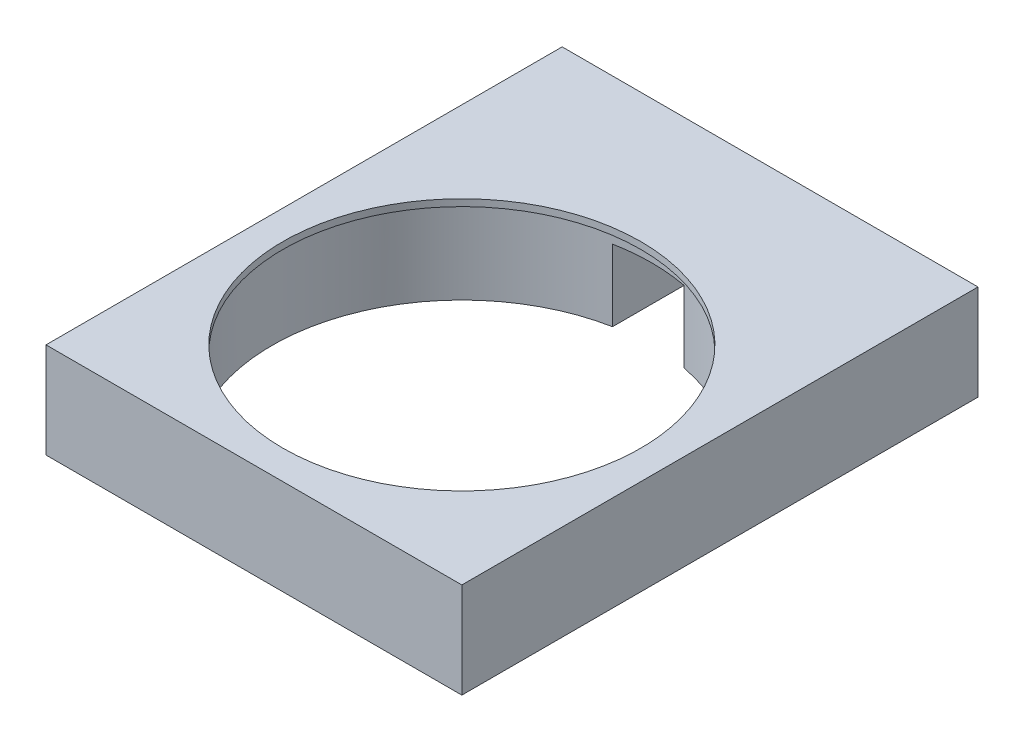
ISO-10303-21;
HEADER;
FILE_DESCRIPTION(('STEP AP214'),'2;1');
FILE_NAME('part.step','',(''),(''),'','','');
FILE_SCHEMA(('AUTOMOTIVE_DESIGN { 1 0 10303 214 1 1 1 1 }'));
ENDSEC;
DATA;
#1=APPLICATION_CONTEXT('core data for automotive mechanical design processes');
#2=APPLICATION_PROTOCOL_DEFINITION('international standard','automotive_design',2000,#1);
#3=PRODUCT_CONTEXT('',#1,'mechanical');
#4=PRODUCT('Part','Part','',(#3));
#5=PRODUCT_RELATED_PRODUCT_CATEGORY('part','',(#4));
#6=PRODUCT_DEFINITION_FORMATION('','',#4);
#7=PRODUCT_DEFINITION_CONTEXT('part definition',#1,'design');
#8=PRODUCT_DEFINITION('design','',#6,#7);
#9=PRODUCT_DEFINITION_SHAPE('','',#8);
#10=(LENGTH_UNIT() NAMED_UNIT(*) SI_UNIT(.MILLI.,.METRE.));
#11=(NAMED_UNIT(*) PLANE_ANGLE_UNIT() SI_UNIT($,.RADIAN.));
#12=(NAMED_UNIT(*) SI_UNIT($,.STERADIAN.) SOLID_ANGLE_UNIT());
#13=UNCERTAINTY_MEASURE_WITH_UNIT(LENGTH_MEASURE(1.E-05),#10,'distance_accuracy_value','');
#14=(GEOMETRIC_REPRESENTATION_CONTEXT(3) GLOBAL_UNCERTAINTY_ASSIGNED_CONTEXT((#13)) GLOBAL_UNIT_ASSIGNED_CONTEXT((#10,
#11,#12)) REPRESENTATION_CONTEXT('',''));
#15=CARTESIAN_POINT('',(0.,0.,0.));
#16=DIRECTION('',(0.,0.,1.));
#17=DIRECTION('',(1.,0.,0.));
#18=AXIS2_PLACEMENT_3D('',#15,#16,#17);
#19=CARTESIAN_POINT('',(2.625,93.,53.1442409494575));
#20=DIRECTION('',(1.,0.,0.));
#21=DIRECTION('',(0.,0.,-1.));
#22=AXIS2_PLACEMENT_3D('',#19,#20,#21);
#23=PLANE('',#22);
#24=DIRECTION('',(0.,0.,-1.));
#25=VECTOR('',#24,1.);
#26=CARTESIAN_POINT('',(2.625,87.75,53.1442409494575));
#27=LINE('',#26,#25);
#28=CARTESIAN_POINT('',(2.625,87.75,47.3246572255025));
#29=VERTEX_POINT('',#28);
#30=CARTESIAN_POINT('',(2.625,87.75,38.3942409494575));
#31=VERTEX_POINT('',#30);
#32=EDGE_CURVE('E167',#29,#31,#27,.T.);
#33=ORIENTED_EDGE('',*,*,#32,.F.);
#34=DIRECTION('',(0.,-1.,0.));
#35=VECTOR('',#34,1.);
#36=CARTESIAN_POINT('',(2.625,94.25,47.3246572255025));
#37=LINE('',#36,#35);
#38=CARTESIAN_POINT('',(2.625,93.,47.3246572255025));
#39=VERTEX_POINT('',#38);
#40=EDGE_CURVE('E140',#29,#39,#37,.F.);
#41=ORIENTED_EDGE('',*,*,#40,.T.);
#42=DIRECTION('',(0.,0.,1.));
#43=VECTOR('',#42,1.);
#44=CARTESIAN_POINT('',(2.625,93.,53.1442409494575));
#45=LINE('',#44,#43);
#46=CARTESIAN_POINT('',(2.625,93.,38.3942409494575));
#47=VERTEX_POINT('',#46);
#48=EDGE_CURVE('E134',#47,#39,#45,.T.);
#49=ORIENTED_EDGE('',*,*,#48,.F.);
#50=DIRECTION('',(0.,1.,0.));
#51=VECTOR('',#50,1.);
#52=CARTESIAN_POINT('',(2.625,93.,38.3942409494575));
#53=LINE('',#52,#51);
#54=EDGE_CURVE('E132',#31,#47,#53,.T.);
#55=ORIENTED_EDGE('',*,*,#54,.F.);
#56=EDGE_LOOP('',(#33,#41,#49,#55));
#57=FACE_BOUND('',#56,.T.);
#58=ADVANCED_FACE('F38',(#57),#23,.F.);
#59=CARTESIAN_POINT('',(-2.625,93.,53.1442409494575));
#60=DIRECTION('',(-1.,0.,0.));
#61=DIRECTION('',(0.,0.,1.));
#62=AXIS2_PLACEMENT_3D('',#59,#60,#61);
#63=PLANE('',#62);
#64=DIRECTION('',(0.,0.,1.));
#65=VECTOR('',#64,1.);
#66=CARTESIAN_POINT('',(-2.625,87.75,53.1442409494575));
#67=LINE('',#66,#65);
#68=CARTESIAN_POINT('',(-2.62499999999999,87.75,38.3942409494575));
#69=VERTEX_POINT('',#68);
#70=CARTESIAN_POINT('',(-2.625,87.75,47.3246572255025));
#71=VERTEX_POINT('',#70);
#72=EDGE_CURVE('E160',#69,#71,#67,.T.);
#73=ORIENTED_EDGE('',*,*,#72,.F.);
#74=DIRECTION('',(0.,-1.,0.));
#75=VECTOR('',#74,1.);
#76=CARTESIAN_POINT('',(-2.625,93.,38.3942409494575));
#77=LINE('',#76,#75);
#78=CARTESIAN_POINT('',(-2.625,93.,38.3942409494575));
#79=VERTEX_POINT('',#78);
#80=EDGE_CURVE('E12',#79,#69,#77,.T.);
#81=ORIENTED_EDGE('',*,*,#80,.F.);
#82=DIRECTION('',(0.,0.,-1.));
#83=VECTOR('',#82,1.);
#84=CARTESIAN_POINT('',(-2.625,93.,53.1442409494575));
#85=LINE('',#84,#83);
#86=CARTESIAN_POINT('',(-2.625,93.,47.3246572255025));
#87=VERTEX_POINT('',#86);
#88=EDGE_CURVE('E137',#87,#79,#85,.T.);
#89=ORIENTED_EDGE('',*,*,#88,.F.);
#90=DIRECTION('',(0.,-1.,0.));
#91=VECTOR('',#90,1.);
#92=CARTESIAN_POINT('',(-2.625,94.25,47.3246572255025));
#93=LINE('',#92,#91);
#94=EDGE_CURVE('E46',#87,#71,#93,.T.);
#95=ORIENTED_EDGE('',*,*,#94,.T.);
#96=EDGE_LOOP('',(#73,#81,#89,#95));
#97=FACE_BOUND('',#96,.T.);
#98=ADVANCED_FACE('F158',(#97),#63,.F.);
#99=CARTESIAN_POINT('',(0.,94.25,61.));
#100=DIRECTION('',(0.,-1.,0.));
#101=DIRECTION('',(0.,0.,-1.));
#102=AXIS2_PLACEMENT_3D('',#99,#100,#101);
#103=CYLINDRICAL_SURFACE('',#102,13.925);
#104=CARTESIAN_POINT('',(0.,94.25,61.));
#105=DIRECTION('',(0.,1.,0.));
#106=DIRECTION('',(0.,0.,1.));
#107=AXIS2_PLACEMENT_3D('',#104,#105,#106);
#108=CIRCLE('',#107,13.925);
#109=CARTESIAN_POINT('',(0.,94.25,74.925));
#110=VERTEX_POINT('',#109);
#111=EDGE_CURVE('E148',#110,#110,#108,.T.);
#112=ORIENTED_EDGE('',*,*,#111,.T.);
#113=EDGE_LOOP('',(#112));
#114=FACE_BOUND('',#113,.T.);
#115=ORIENTED_EDGE('',*,*,#40,.F.);
#116=CARTESIAN_POINT('',(0.,87.75,61.));
#117=DIRECTION('',(0.,-1.,0.));
#118=DIRECTION('',(0.,0.,-1.));
#119=AXIS2_PLACEMENT_3D('',#116,#117,#118);
#120=CIRCLE('',#119,13.925);
#121=EDGE_CURVE('E164',#29,#71,#120,.T.);
#122=ORIENTED_EDGE('',*,*,#121,.T.);
#123=ORIENTED_EDGE('',*,*,#94,.F.);
#124=CARTESIAN_POINT('',(0.,93.,61.));
#125=DIRECTION('',(0.,-1.,0.));
#126=DIRECTION('',(0.,0.,-1.));
#127=AXIS2_PLACEMENT_3D('',#124,#125,#126);
#128=CIRCLE('',#127,13.925);
#129=EDGE_CURVE('E151',#87,#39,#128,.T.);
#130=ORIENTED_EDGE('',*,*,#129,.T.);
#131=EDGE_LOOP('',(#115,#122,#123,#130));
#132=FACE_BOUND('',#131,.T.);
#133=ADVANCED_FACE('F40',(#114,#132),#103,.F.);
#134=CARTESIAN_POINT('',(-15.25,87.5,38.3942409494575));
#135=DIRECTION('',(0.,0.,-1.));
#136=DIRECTION('',(-1.,0.,0.));
#137=AXIS2_PLACEMENT_3D('',#134,#135,#136);
#138=PLANE('',#137);
#139=DIRECTION('',(0.,1.,0.));
#140=VECTOR('',#139,1.);
#141=CARTESIAN_POINT('',(15.25,87.5,38.3942409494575));
#142=LINE('',#141,#140);
#143=CARTESIAN_POINT('',(15.25,87.75,38.3942409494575));
#144=VERTEX_POINT('',#143);
#145=CARTESIAN_POINT('',(15.25,94.75,38.3942409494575));
#146=VERTEX_POINT('',#145);
#147=EDGE_CURVE('E122',#144,#146,#142,.T.);
#148=ORIENTED_EDGE('',*,*,#147,.F.);
#149=DIRECTION('',(-1.,0.,0.));
#150=VECTOR('',#149,1.);
#151=CARTESIAN_POINT('',(15.25,87.75,38.3942409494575));
#152=LINE('',#151,#150);
#153=EDGE_CURVE('E169',#144,#31,#152,.T.);
#154=ORIENTED_EDGE('',*,*,#153,.T.);
#155=ORIENTED_EDGE('',*,*,#54,.T.);
#156=DIRECTION('',(1.,0.,0.));
#157=VECTOR('',#156,1.);
#158=CARTESIAN_POINT('',(-0.5,93.,38.3942409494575));
#159=LINE('',#158,#157);
#160=EDGE_CURVE('E129',#79,#47,#159,.T.);
#161=ORIENTED_EDGE('',*,*,#160,.F.);
#162=ORIENTED_EDGE('',*,*,#80,.T.);
#163=CARTESIAN_POINT('',(-15.25,87.75,38.3942409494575));
#164=VERTEX_POINT('',#163);
#165=EDGE_CURVE('E114',#69,#164,#152,.T.);
#166=ORIENTED_EDGE('',*,*,#165,.T.);
#167=DIRECTION('',(0.,1.,0.));
#168=VECTOR('',#167,1.);
#169=CARTESIAN_POINT('',(-15.25,87.5,38.3942409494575));
#170=LINE('',#169,#168);
#171=CARTESIAN_POINT('',(-15.25,94.75,38.3942409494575));
#172=VERTEX_POINT('',#171);
#173=EDGE_CURVE('E113',#164,#172,#170,.T.);
#174=ORIENTED_EDGE('',*,*,#173,.T.);
#175=DIRECTION('',(-1.,0.,0.));
#176=VECTOR('',#175,1.);
#177=CARTESIAN_POINT('',(-15.25,94.75,38.3942409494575));
#178=LINE('',#177,#176);
#179=EDGE_CURVE('E120',#146,#172,#178,.T.);
#180=ORIENTED_EDGE('',*,*,#179,.F.);
#181=EDGE_LOOP('',(#148,#154,#155,#161,#162,#166,#174,#180));
#182=FACE_BOUND('',#181,.T.);
#183=ADVANCED_FACE('F185',(#182),#138,.T.);
#184=CARTESIAN_POINT('',(-15.25,87.5,38.3942409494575));
#185=DIRECTION('',(-1.,0.,0.));
#186=DIRECTION('',(0.,0.,1.));
#187=AXIS2_PLACEMENT_3D('',#184,#185,#186);
#188=PLANE('',#187);
#189=ORIENTED_EDGE('',*,*,#173,.F.);
#190=DIRECTION('',(0.,0.,-1.));
#191=VECTOR('',#190,1.);
#192=CARTESIAN_POINT('',(-15.25,87.75,76.25));
#193=LINE('',#192,#191);
#194=CARTESIAN_POINT('',(-15.25,87.75,76.25));
#195=VERTEX_POINT('',#194);
#196=EDGE_CURVE('E104',#195,#164,#193,.T.);
#197=ORIENTED_EDGE('',*,*,#196,.F.);
#198=DIRECTION('',(0.,1.,0.));
#199=VECTOR('',#198,1.);
#200=CARTESIAN_POINT('',(-15.25,87.5,76.25));
#201=LINE('',#200,#199);
#202=CARTESIAN_POINT('',(-15.25,94.75,76.25));
#203=VERTEX_POINT('',#202);
#204=EDGE_CURVE('E112',#195,#203,#201,.T.);
#205=ORIENTED_EDGE('',*,*,#204,.T.);
#206=DIRECTION('',(0.,0.,1.));
#207=VECTOR('',#206,1.);
#208=CARTESIAN_POINT('',(-15.25,94.75,38.3942409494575));
#209=LINE('',#208,#207);
#210=EDGE_CURVE('E174',#172,#203,#209,.T.);
#211=ORIENTED_EDGE('',*,*,#210,.F.);
#212=EDGE_LOOP('',(#189,#197,#205,#211));
#213=FACE_BOUND('',#212,.T.);
#214=ADVANCED_FACE('F110',(#213),#188,.T.);
#215=CARTESIAN_POINT('',(15.25,87.5,38.3942409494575));
#216=DIRECTION('',(1.,0.,0.));
#217=DIRECTION('',(0.,0.,-1.));
#218=AXIS2_PLACEMENT_3D('',#215,#216,#217);
#219=PLANE('',#218);
#220=DIRECTION('',(0.,1.,0.));
#221=VECTOR('',#220,1.);
#222=CARTESIAN_POINT('',(15.25,87.5,76.25));
#223=LINE('',#222,#221);
#224=CARTESIAN_POINT('',(15.25,87.75,76.25));
#225=VERTEX_POINT('',#224);
#226=CARTESIAN_POINT('',(15.25,94.75,76.25));
#227=VERTEX_POINT('',#226);
#228=EDGE_CURVE('E60',#225,#227,#223,.T.);
#229=ORIENTED_EDGE('',*,*,#228,.F.);
#230=DIRECTION('',(0.,0.,-1.));
#231=VECTOR('',#230,1.);
#232=CARTESIAN_POINT('',(15.25,87.75,76.25));
#233=LINE('',#232,#231);
#234=EDGE_CURVE('E53',#225,#144,#233,.T.);
#235=ORIENTED_EDGE('',*,*,#234,.T.);
#236=ORIENTED_EDGE('',*,*,#147,.T.);
#237=DIRECTION('',(0.,0.,-1.));
#238=VECTOR('',#237,1.);
#239=CARTESIAN_POINT('',(15.25,94.75,38.3942409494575));
#240=LINE('',#239,#238);
#241=EDGE_CURVE('E125',#227,#146,#240,.T.);
#242=ORIENTED_EDGE('',*,*,#241,.F.);
#243=EDGE_LOOP('',(#229,#235,#236,#242));
#244=FACE_BOUND('',#243,.T.);
#245=ADVANCED_FACE('F182',(#244),#219,.T.);
#246=CARTESIAN_POINT('',(-15.25,87.5,76.25));
#247=DIRECTION('',(0.,0.,1.));
#248=DIRECTION('',(1.,0.,0.));
#249=AXIS2_PLACEMENT_3D('',#246,#247,#248);
#250=PLANE('',#249);
#251=ORIENTED_EDGE('',*,*,#204,.F.);
#252=DIRECTION('',(-1.,0.,0.));
#253=VECTOR('',#252,1.);
#254=CARTESIAN_POINT('',(15.25,87.75,76.25));
#255=LINE('',#254,#253);
#256=EDGE_CURVE('E101',#225,#195,#255,.T.);
#257=ORIENTED_EDGE('',*,*,#256,.F.);
#258=ORIENTED_EDGE('',*,*,#228,.T.);
#259=DIRECTION('',(1.,0.,0.));
#260=VECTOR('',#259,1.);
#261=CARTESIAN_POINT('',(-15.25,94.75,76.25));
#262=LINE('',#261,#260);
#263=EDGE_CURVE('E118',#203,#227,#262,.T.);
#264=ORIENTED_EDGE('',*,*,#263,.F.);
#265=EDGE_LOOP('',(#251,#257,#258,#264));
#266=FACE_BOUND('',#265,.T.);
#267=ADVANCED_FACE('F116',(#266),#250,.T.);
#268=CARTESIAN_POINT('',(-0.5,93.,20.3203719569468));
#269=DIRECTION('',(0.,-1.,0.));
#270=DIRECTION('',(0.,0.,-1.));
#271=AXIS2_PLACEMENT_3D('',#268,#269,#270);
#272=PLANE('',#271);
#273=ORIENTED_EDGE('',*,*,#88,.T.);
#274=ORIENTED_EDGE('',*,*,#160,.T.);
#275=ORIENTED_EDGE('',*,*,#48,.T.);
#276=ORIENTED_EDGE('',*,*,#129,.F.);
#277=EDGE_LOOP('',(#273,#274,#275,#276));
#278=FACE_BOUND('',#277,.T.);
#279=ADVANCED_FACE('F190',(#278),#272,.T.);
#280=CARTESIAN_POINT('',(19.,94.75,81.6254524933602));
#281=DIRECTION('',(0.,1.,0.));
#282=DIRECTION('',(0.,0.,1.));
#283=AXIS2_PLACEMENT_3D('',#280,#281,#282);
#284=PLANE('',#283);
#285=CARTESIAN_POINT('',(0.,94.75,61.));
#286=DIRECTION('',(0.,1.,0.));
#287=DIRECTION('',(0.,0.,1.));
#288=AXIS2_PLACEMENT_3D('',#285,#286,#287);
#289=CIRCLE('',#288,13.125);
#290=CARTESIAN_POINT('',(0.,94.75,74.125));
#291=VERTEX_POINT('',#290);
#292=EDGE_CURVE('E142',#291,#291,#289,.T.);
#293=ORIENTED_EDGE('',*,*,#292,.F.);
#294=EDGE_LOOP('',(#293));
#295=FACE_BOUND('',#294,.T.);
#296=ORIENTED_EDGE('',*,*,#179,.T.);
#297=ORIENTED_EDGE('',*,*,#210,.T.);
#298=ORIENTED_EDGE('',*,*,#263,.T.);
#299=ORIENTED_EDGE('',*,*,#241,.T.);
#300=EDGE_LOOP('',(#296,#297,#298,#299));
#301=FACE_BOUND('',#300,.T.);
#302=ADVANCED_FACE('F187',(#295,#301),#284,.T.);
#303=CARTESIAN_POINT('',(0.,94.25,61.));
#304=DIRECTION('',(0.,1.,0.));
#305=DIRECTION('',(0.,0.,1.));
#306=AXIS2_PLACEMENT_3D('',#303,#304,#305);
#307=PLANE('',#306);
#308=CARTESIAN_POINT('',(0.,94.25,61.));
#309=DIRECTION('',(0.,1.,0.));
#310=DIRECTION('',(0.,0.,1.));
#311=AXIS2_PLACEMENT_3D('',#308,#309,#310);
#312=CIRCLE('',#311,13.125);
#313=CARTESIAN_POINT('',(0.,94.25,74.125));
#314=VERTEX_POINT('',#313);
#315=EDGE_CURVE('E145',#314,#314,#312,.F.);
#316=ORIENTED_EDGE('',*,*,#315,.F.);
#317=EDGE_LOOP('',(#316));
#318=FACE_BOUND('',#317,.T.);
#319=ORIENTED_EDGE('',*,*,#111,.F.);
#320=EDGE_LOOP('',(#319));
#321=FACE_BOUND('',#320,.T.);
#322=ADVANCED_FACE('F189',(#318,#321),#307,.F.);
#323=CARTESIAN_POINT('',(0.,87.499,61.));
#324=DIRECTION('',(0.,1.,0.));
#325=DIRECTION('',(0.,0.,1.));
#326=AXIS2_PLACEMENT_3D('',#323,#324,#325);
#327=CYLINDRICAL_SURFACE('',#326,13.125);
#328=ORIENTED_EDGE('',*,*,#292,.T.);
#329=EDGE_LOOP('',(#328));
#330=FACE_BOUND('',#329,.T.);
#331=ORIENTED_EDGE('',*,*,#315,.T.);
#332=EDGE_LOOP('',(#331));
#333=FACE_BOUND('',#332,.T.);
#334=ADVANCED_FACE('F197',(#330,#333),#327,.F.);
#335=CARTESIAN_POINT('',(0.,87.75,0.));
#336=DIRECTION('',(0.,-1.,0.));
#337=DIRECTION('',(0.,0.,-1.));
#338=AXIS2_PLACEMENT_3D('',#335,#336,#337);
#339=PLANE('',#338);
#340=ORIENTED_EDGE('',*,*,#32,.T.);
#341=ORIENTED_EDGE('',*,*,#153,.F.);
#342=ORIENTED_EDGE('',*,*,#234,.F.);
#343=ORIENTED_EDGE('',*,*,#256,.T.);
#344=ORIENTED_EDGE('',*,*,#196,.T.);
#345=ORIENTED_EDGE('',*,*,#165,.F.);
#346=ORIENTED_EDGE('',*,*,#72,.T.);
#347=ORIENTED_EDGE('',*,*,#121,.F.);
#348=EDGE_LOOP('',(#340,#341,#342,#343,#344,#345,#346,#347));
#349=FACE_BOUND('',#348,.T.);
#350=ADVANCED_FACE('F103',(#349),#339,.T.);
#351=CLOSED_SHELL('',(#58,#98,#133,#183,#214,#245,#267,#279,#302,#322,#334,#350));
#352=MANIFOLD_SOLID_BREP('B2',#351);
#353=ADVANCED_BREP_SHAPE_REPRESENTATION('',(#18,#352),#14);
#354=SHAPE_DEFINITION_REPRESENTATION(#9,#353);
ENDSEC;
END-ISO-10303-21;
